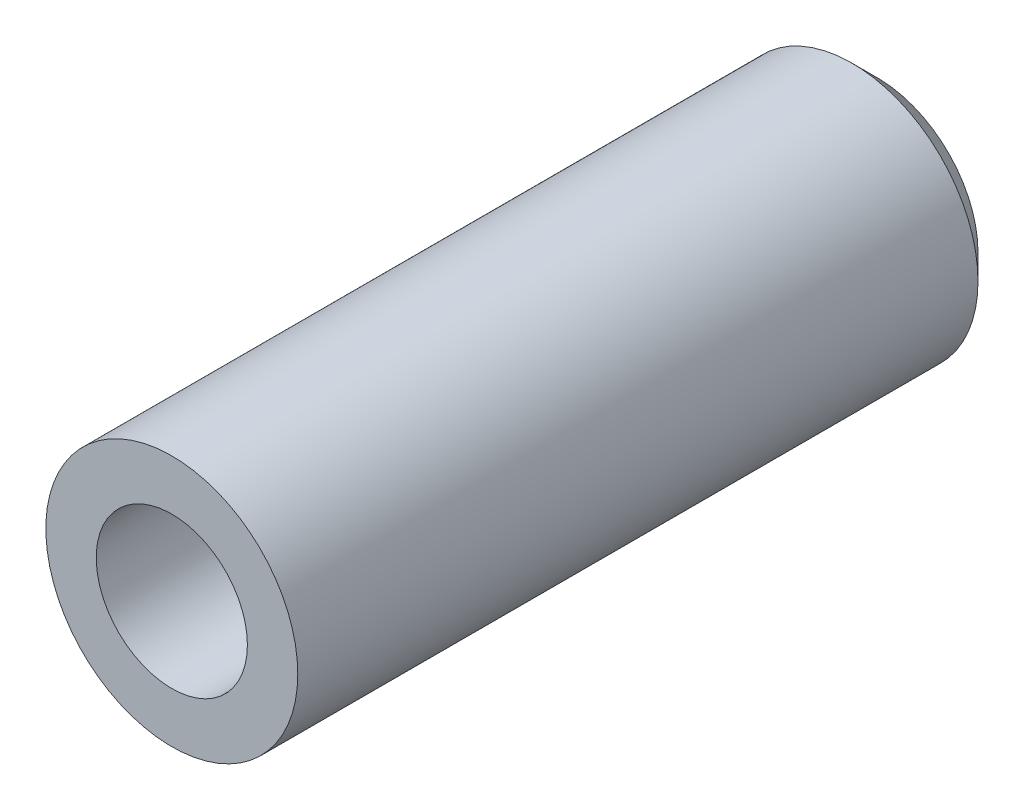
ISO-10303-21;
HEADER;
FILE_DESCRIPTION(('STEP AP214'),'2;1');
FILE_NAME('part.step','',(''),(''),'','','');
FILE_SCHEMA(('AUTOMOTIVE_DESIGN { 1 0 10303 214 1 1 1 1 }'));
ENDSEC;
DATA;
#1=APPLICATION_CONTEXT('core data for automotive mechanical design processes');
#2=APPLICATION_PROTOCOL_DEFINITION('international standard','automotive_design',2000,#1);
#3=PRODUCT_CONTEXT('',#1,'mechanical');
#4=PRODUCT('Part','Part','',(#3));
#5=PRODUCT_RELATED_PRODUCT_CATEGORY('part','',(#4));
#6=PRODUCT_DEFINITION_FORMATION('','',#4);
#7=PRODUCT_DEFINITION_CONTEXT('part definition',#1,'design');
#8=PRODUCT_DEFINITION('design','',#6,#7);
#9=PRODUCT_DEFINITION_SHAPE('','',#8);
#10=(LENGTH_UNIT() NAMED_UNIT(*) SI_UNIT(.MILLI.,.METRE.));
#11=(NAMED_UNIT(*) PLANE_ANGLE_UNIT() SI_UNIT($,.RADIAN.));
#12=(NAMED_UNIT(*) SI_UNIT($,.STERADIAN.) SOLID_ANGLE_UNIT());
#13=UNCERTAINTY_MEASURE_WITH_UNIT(LENGTH_MEASURE(1.E-05),#10,'distance_accuracy_value','');
#14=(GEOMETRIC_REPRESENTATION_CONTEXT(3) GLOBAL_UNCERTAINTY_ASSIGNED_CONTEXT((#13)) GLOBAL_UNIT_ASSIGNED_CONTEXT((#10,
#11,#12)) REPRESENTATION_CONTEXT('',''));
#15=CARTESIAN_POINT('',(0.,0.,0.));
#16=DIRECTION('',(0.,0.,1.));
#17=DIRECTION('',(1.,0.,0.));
#18=AXIS2_PLACEMENT_3D('',#15,#16,#17);
#19=CARTESIAN_POINT('',(38.3796142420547,299.393845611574,28.));
#20=DIRECTION('',(0.,0.,-1.));
#21=DIRECTION('',(-1.,0.,0.));
#22=AXIS2_PLACEMENT_3D('',#19,#20,#21);
#23=CYLINDRICAL_SURFACE('',#22,4.9999999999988);
#24=CARTESIAN_POINT('',(38.3796142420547,299.393845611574,0.999999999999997));
#25=DIRECTION('',(0.,0.,1.));
#26=DIRECTION('',(1.,0.,0.));
#27=AXIS2_PLACEMENT_3D('',#24,#25,#26);
#28=CIRCLE('',#27,4.9999999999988);
#29=CARTESIAN_POINT('',(43.3796142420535,299.393845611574,0.999999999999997));
#30=VERTEX_POINT('',#29);
#31=EDGE_CURVE('E43',#30,#30,#28,.T.);
#32=ORIENTED_EDGE('',*,*,#31,.T.);
#33=EDGE_LOOP('',(#32));
#34=FACE_BOUND('',#33,.T.);
#35=CARTESIAN_POINT('',(38.3796142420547,299.393845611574,28.));
#36=DIRECTION('',(0.,0.,1.));
#37=DIRECTION('',(1.,0.,0.));
#38=AXIS2_PLACEMENT_3D('',#35,#36,#37);
#39=CIRCLE('',#38,4.9999999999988);
#40=CARTESIAN_POINT('',(43.3796142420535,299.393845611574,28.));
#41=VERTEX_POINT('',#40);
#42=EDGE_CURVE('E47',#41,#41,#39,.T.);
#43=ORIENTED_EDGE('',*,*,#42,.F.);
#44=EDGE_LOOP('',(#43));
#45=FACE_BOUND('',#44,.T.);
#46=ADVANCED_FACE('F36',(#34,#45),#23,.T.);
#47=CARTESIAN_POINT('',(38.3796142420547,299.393845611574,28.));
#48=DIRECTION('',(0.,0.,1.));
#49=DIRECTION('',(1.,0.,0.));
#50=AXIS2_PLACEMENT_3D('',#47,#48,#49);
#51=PLANE('',#50);
#52=CARTESIAN_POINT('',(38.3796142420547,299.393845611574,28.));
#53=DIRECTION('',(0.,0.,1.));
#54=DIRECTION('',(1.,0.,0.));
#55=AXIS2_PLACEMENT_3D('',#52,#53,#54);
#56=CIRCLE('',#55,3.);
#57=CARTESIAN_POINT('',(41.3796142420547,299.393845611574,28.));
#58=VERTEX_POINT('',#57);
#59=EDGE_CURVE('E54',#58,#58,#56,.T.);
#60=ORIENTED_EDGE('',*,*,#59,.F.);
#61=EDGE_LOOP('',(#60));
#62=FACE_BOUND('',#61,.T.);
#63=ORIENTED_EDGE('',*,*,#42,.T.);
#64=EDGE_LOOP('',(#63));
#65=FACE_BOUND('',#64,.T.);
#66=ADVANCED_FACE('F86',(#62,#65),#51,.T.);
#67=CARTESIAN_POINT('',(38.3796142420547,299.393845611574,0.));
#68=DIRECTION('',(0.,0.,1.));
#69=DIRECTION('',(1.,0.,0.));
#70=AXIS2_PLACEMENT_3D('',#67,#68,#69);
#71=PLANE('',#70);
#72=CARTESIAN_POINT('',(38.3796142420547,299.393845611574,0.));
#73=DIRECTION('',(0.,0.,1.));
#74=DIRECTION('',(1.,0.,0.));
#75=AXIS2_PLACEMENT_3D('',#72,#73,#74);
#76=CIRCLE('',#75,3.9999999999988);
#77=CARTESIAN_POINT('',(42.3796142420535,299.393845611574,0.));
#78=VERTEX_POINT('',#77);
#79=EDGE_CURVE('E10',#78,#78,#76,.F.);
#80=ORIENTED_EDGE('',*,*,#79,.T.);
#81=EDGE_LOOP('',(#80));
#82=FACE_BOUND('',#81,.T.);
#83=CARTESIAN_POINT('',(38.3796142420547,299.393845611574,0.));
#84=DIRECTION('',(0.,0.,1.));
#85=DIRECTION('',(1.,0.,0.));
#86=AXIS2_PLACEMENT_3D('',#83,#84,#85);
#87=CIRCLE('',#86,0.999999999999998);
#88=CARTESIAN_POINT('',(39.3796142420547,299.393845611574,0.));
#89=VERTEX_POINT('',#88);
#90=EDGE_CURVE('E57',#89,#89,#87,.T.);
#91=ORIENTED_EDGE('',*,*,#90,.T.);
#92=EDGE_LOOP('',(#91));
#93=FACE_BOUND('',#92,.T.);
#94=ADVANCED_FACE('F66',(#82,#93),#71,.F.);
#95=CARTESIAN_POINT('',(38.3796142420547,299.393845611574,15.));
#96=DIRECTION('',(0.,0.,1.));
#97=DIRECTION('',(1.,0.,0.));
#98=AXIS2_PLACEMENT_3D('',#95,#96,#97);
#99=CYLINDRICAL_SURFACE('',#98,3.);
#100=CARTESIAN_POINT('',(38.3796142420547,299.393845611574,15.));
#101=DIRECTION('',(0.,0.,1.));
#102=DIRECTION('',(1.,0.,0.));
#103=AXIS2_PLACEMENT_3D('',#100,#101,#102);
#104=CIRCLE('',#103,3.);
#105=CARTESIAN_POINT('',(41.3796142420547,299.393845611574,15.));
#106=VERTEX_POINT('',#105);
#107=EDGE_CURVE('E51',#106,#106,#104,.T.);
#108=CARTESIAN_POINT('',(41.3796142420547,299.393845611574,15.));
#109=CARTESIAN_POINT('',(41.3796142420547,299.393845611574,15.1354166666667));
#110=CARTESIAN_POINT('',(41.3796142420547,299.393845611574,15.2708333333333));
#111=CARTESIAN_POINT('',(41.3796142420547,299.393845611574,15.5416666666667));
#112=CARTESIAN_POINT('',(41.3796142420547,299.393845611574,15.6770833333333));
#113=CARTESIAN_POINT('',(41.3796142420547,299.393845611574,15.9479166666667));
#114=CARTESIAN_POINT('',(41.3796142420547,299.393845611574,16.0833333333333));
#115=CARTESIAN_POINT('',(41.3796142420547,299.393845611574,16.3541666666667));
#116=CARTESIAN_POINT('',(41.3796142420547,299.393845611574,16.4895833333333));
#117=CARTESIAN_POINT('',(41.3796142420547,299.393845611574,16.7604166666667));
#118=CARTESIAN_POINT('',(41.3796142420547,299.393845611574,16.8958333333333));
#119=CARTESIAN_POINT('',(41.3796142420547,299.393845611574,17.1666666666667));
#120=CARTESIAN_POINT('',(41.3796142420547,299.393845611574,17.3020833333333));
#121=CARTESIAN_POINT('',(41.3796142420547,299.393845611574,17.5729166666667));
#122=CARTESIAN_POINT('',(41.3796142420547,299.393845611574,17.7083333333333));
#123=CARTESIAN_POINT('',(41.3796142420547,299.393845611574,17.9791666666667));
#124=CARTESIAN_POINT('',(41.3796142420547,299.393845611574,18.1145833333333));
#125=CARTESIAN_POINT('',(41.3796142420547,299.393845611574,18.3854166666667));
#126=CARTESIAN_POINT('',(41.3796142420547,299.393845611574,18.5208333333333));
#127=CARTESIAN_POINT('',(41.3796142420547,299.393845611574,18.7916666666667));
#128=CARTESIAN_POINT('',(41.3796142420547,299.393845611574,18.9270833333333));
#129=CARTESIAN_POINT('',(41.3796142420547,299.393845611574,19.1979166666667));
#130=CARTESIAN_POINT('',(41.3796142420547,299.393845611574,19.3333333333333));
#131=CARTESIAN_POINT('',(41.3796142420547,299.393845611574,19.6041666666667));
#132=CARTESIAN_POINT('',(41.3796142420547,299.393845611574,19.7395833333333));
#133=CARTESIAN_POINT('',(41.3796142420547,299.393845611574,20.0104166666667));
#134=CARTESIAN_POINT('',(41.3796142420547,299.393845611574,20.1458333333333));
#135=CARTESIAN_POINT('',(41.3796142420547,299.393845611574,20.4166666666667));
#136=CARTESIAN_POINT('',(41.3796142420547,299.393845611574,20.5520833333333));
#137=CARTESIAN_POINT('',(41.3796142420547,299.393845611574,20.8229166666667));
#138=CARTESIAN_POINT('',(41.3796142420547,299.393845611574,20.9583333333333));
#139=CARTESIAN_POINT('',(41.3796142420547,299.393845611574,21.2291666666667));
#140=CARTESIAN_POINT('',(41.3796142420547,299.393845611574,21.3645833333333));
#141=CARTESIAN_POINT('',(41.3796142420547,299.393845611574,21.6354166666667));
#142=CARTESIAN_POINT('',(41.3796142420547,299.393845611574,21.7708333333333));
#143=CARTESIAN_POINT('',(41.3796142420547,299.393845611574,22.0416666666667));
#144=CARTESIAN_POINT('',(41.3796142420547,299.393845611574,22.1770833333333));
#145=CARTESIAN_POINT('',(41.3796142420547,299.393845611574,22.4479166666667));
#146=CARTESIAN_POINT('',(41.3796142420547,299.393845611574,22.5833333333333));
#147=CARTESIAN_POINT('',(41.3796142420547,299.393845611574,22.8541666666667));
#148=CARTESIAN_POINT('',(41.3796142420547,299.393845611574,22.9895833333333));
#149=CARTESIAN_POINT('',(41.3796142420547,299.393845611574,23.2604166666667));
#150=CARTESIAN_POINT('',(41.3796142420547,299.393845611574,23.3958333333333));
#151=CARTESIAN_POINT('',(41.3796142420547,299.393845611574,23.6666666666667));
#152=CARTESIAN_POINT('',(41.3796142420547,299.393845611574,23.8020833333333));
#153=CARTESIAN_POINT('',(41.3796142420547,299.393845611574,24.0729166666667));
#154=CARTESIAN_POINT('',(41.3796142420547,299.393845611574,24.2083333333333));
#155=CARTESIAN_POINT('',(41.3796142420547,299.393845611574,24.4791666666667));
#156=CARTESIAN_POINT('',(41.3796142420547,299.393845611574,24.6145833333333));
#157=CARTESIAN_POINT('',(41.3796142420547,299.393845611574,24.8854166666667));
#158=CARTESIAN_POINT('',(41.3796142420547,299.393845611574,25.0208333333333));
#159=CARTESIAN_POINT('',(41.3796142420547,299.393845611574,25.2916666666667));
#160=CARTESIAN_POINT('',(41.3796142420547,299.393845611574,25.4270833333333));
#161=CARTESIAN_POINT('',(41.3796142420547,299.393845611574,25.6979166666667));
#162=CARTESIAN_POINT('',(41.3796142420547,299.393845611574,25.8333333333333));
#163=CARTESIAN_POINT('',(41.3796142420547,299.393845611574,26.1041666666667));
#164=CARTESIAN_POINT('',(41.3796142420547,299.393845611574,26.2395833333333));
#165=CARTESIAN_POINT('',(41.3796142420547,299.393845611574,26.5104166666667));
#166=CARTESIAN_POINT('',(41.3796142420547,299.393845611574,26.6458333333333));
#167=CARTESIAN_POINT('',(41.3796142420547,299.393845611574,26.9166666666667));
#168=CARTESIAN_POINT('',(41.3796142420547,299.393845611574,27.0520833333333));
#169=CARTESIAN_POINT('',(41.3796142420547,299.393845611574,27.3229166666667));
#170=CARTESIAN_POINT('',(41.3796142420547,299.393845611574,27.4583333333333));
#171=CARTESIAN_POINT('',(41.3796142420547,299.393845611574,27.7291666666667));
#172=CARTESIAN_POINT('',(41.3796142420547,299.393845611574,27.8645833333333));
#173=CARTESIAN_POINT('',(41.3796142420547,299.393845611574,28.));
#174=B_SPLINE_CURVE_WITH_KNOTS('',3,(#108,#109,#110,#111,#112,#113,#114,#115,#116,#117,#118,
#119,#120,#121,#122,#123,#124,#125,#126,#127,#128,#129,#130,#131,#132,#133,#134,#135,#136,#137,
#138,#139,#140,#141,#142,#143,#144,#145,#146,#147,#148,#149,#150,#151,#152,#153,#154,#155,#156,
#157,#158,#159,#160,#161,#162,#163,#164,#165,#166,#167,#168,#169,#170,#171,#172,#173),
.UNSPECIFIED.,.F.,.F.,(4,2,2,2,2,2,2,2,2,2,2,2,2,2,2,2,2,2,2,2,2,2,2,2,2,2,2,2,2,2,2,2,4),(0.,
0.406249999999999,0.812499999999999,1.21875,1.625,2.03125,2.4375,2.84375,3.25,3.65625,4.0625,
4.46875,4.875,5.28125,5.6875,6.09375,6.5,6.90625,7.3125,7.71875,8.125,8.53125,8.9375,9.34375,
9.75,10.15625,10.5625,10.96875,11.375,11.78125,12.1875,12.59375,13.),.UNSPECIFIED.);
#175=EDGE_CURVE('BSEAM77',#106,#58,#174,.T.);
#176=ORIENTED_EDGE('',*,*,#107,.F.);
#177=ORIENTED_EDGE('',*,*,#59,.T.);
#178=ORIENTED_EDGE('',*,*,#175,.T.);
#179=ORIENTED_EDGE('',*,*,#175,.F.);
#180=EDGE_LOOP('',(#176,#178,#177,#179));
#181=FACE_BOUND('',#180,.T.);
#182=ADVANCED_FACE('F77',(#181),#99,.F.);
#183=CARTESIAN_POINT('',(38.3796142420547,299.393845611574,15.));
#184=DIRECTION('',(0.,0.,1.));
#185=DIRECTION('',(1.,0.,0.));
#186=AXIS2_PLACEMENT_3D('',#183,#184,#185);
#187=PLANE('',#186);
#188=CARTESIAN_POINT('',(38.3796142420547,299.393845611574,15.));
#189=DIRECTION('',(0.,0.,1.));
#190=DIRECTION('',(1.,0.,0.));
#191=AXIS2_PLACEMENT_3D('',#188,#189,#190);
#192=CIRCLE('',#191,0.999999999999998);
#193=CARTESIAN_POINT('',(39.3796142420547,299.393845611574,15.));
#194=VERTEX_POINT('',#193);
#195=EDGE_CURVE('E60',#194,#194,#192,.T.);
#196=ORIENTED_EDGE('',*,*,#195,.F.);
#197=EDGE_LOOP('',(#196));
#198=FACE_BOUND('',#197,.T.);
#199=ORIENTED_EDGE('',*,*,#107,.T.);
#200=EDGE_LOOP('',(#199));
#201=FACE_BOUND('',#200,.T.);
#202=ADVANCED_FACE('F71',(#198,#201),#187,.T.);
#203=CARTESIAN_POINT('',(38.3796142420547,299.393845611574,0.));
#204=DIRECTION('',(0.,0.,1.));
#205=DIRECTION('',(1.,0.,0.));
#206=AXIS2_PLACEMENT_3D('',#203,#204,#205);
#207=CYLINDRICAL_SURFACE('',#206,0.999999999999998);
#208=CARTESIAN_POINT('',(39.3796142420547,299.393845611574,0.));
#209=CARTESIAN_POINT('',(39.3796142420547,299.393845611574,0.15625));
#210=CARTESIAN_POINT('',(39.3796142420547,299.393845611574,0.3125));
#211=CARTESIAN_POINT('',(39.3796142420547,299.393845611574,0.625));
#212=CARTESIAN_POINT('',(39.3796142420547,299.393845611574,0.78125));
#213=CARTESIAN_POINT('',(39.3796142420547,299.393845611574,1.09375));
#214=CARTESIAN_POINT('',(39.3796142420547,299.393845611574,1.25));
#215=CARTESIAN_POINT('',(39.3796142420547,299.393845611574,1.5625));
#216=CARTESIAN_POINT('',(39.3796142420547,299.393845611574,1.71875));
#217=CARTESIAN_POINT('',(39.3796142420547,299.393845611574,2.03125));
#218=CARTESIAN_POINT('',(39.3796142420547,299.393845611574,2.1875));
#219=CARTESIAN_POINT('',(39.3796142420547,299.393845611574,2.5));
#220=CARTESIAN_POINT('',(39.3796142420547,299.393845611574,2.65625));
#221=CARTESIAN_POINT('',(39.3796142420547,299.393845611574,2.96875));
#222=CARTESIAN_POINT('',(39.3796142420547,299.393845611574,3.125));
#223=CARTESIAN_POINT('',(39.3796142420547,299.393845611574,3.4375));
#224=CARTESIAN_POINT('',(39.3796142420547,299.393845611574,3.59375));
#225=CARTESIAN_POINT('',(39.3796142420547,299.393845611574,3.90625));
#226=CARTESIAN_POINT('',(39.3796142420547,299.393845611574,4.0625));
#227=CARTESIAN_POINT('',(39.3796142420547,299.393845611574,4.375));
#228=CARTESIAN_POINT('',(39.3796142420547,299.393845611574,4.53125));
#229=CARTESIAN_POINT('',(39.3796142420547,299.393845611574,4.84375));
#230=CARTESIAN_POINT('',(39.3796142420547,299.393845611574,5.));
#231=CARTESIAN_POINT('',(39.3796142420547,299.393845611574,5.3125));
#232=CARTESIAN_POINT('',(39.3796142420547,299.393845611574,5.46875));
#233=CARTESIAN_POINT('',(39.3796142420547,299.393845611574,5.78125));
#234=CARTESIAN_POINT('',(39.3796142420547,299.393845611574,5.9375));
#235=CARTESIAN_POINT('',(39.3796142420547,299.393845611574,6.25));
#236=CARTESIAN_POINT('',(39.3796142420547,299.393845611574,6.40625));
#237=CARTESIAN_POINT('',(39.3796142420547,299.393845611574,6.71875));
#238=CARTESIAN_POINT('',(39.3796142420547,299.393845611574,6.875));
#239=CARTESIAN_POINT('',(39.3796142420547,299.393845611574,7.1875));
#240=CARTESIAN_POINT('',(39.3796142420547,299.393845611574,7.34375));
#241=CARTESIAN_POINT('',(39.3796142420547,299.393845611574,7.65625));
#242=CARTESIAN_POINT('',(39.3796142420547,299.393845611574,7.8125));
#243=CARTESIAN_POINT('',(39.3796142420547,299.393845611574,8.125));
#244=CARTESIAN_POINT('',(39.3796142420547,299.393845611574,8.28125));
#245=CARTESIAN_POINT('',(39.3796142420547,299.393845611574,8.59375));
#246=CARTESIAN_POINT('',(39.3796142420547,299.393845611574,8.75));
#247=CARTESIAN_POINT('',(39.3796142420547,299.393845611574,9.0625));
#248=CARTESIAN_POINT('',(39.3796142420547,299.393845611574,9.21875));
#249=CARTESIAN_POINT('',(39.3796142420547,299.393845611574,9.53125));
#250=CARTESIAN_POINT('',(39.3796142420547,299.393845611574,9.6875));
#251=CARTESIAN_POINT('',(39.3796142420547,299.393845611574,10.));
#252=CARTESIAN_POINT('',(39.3796142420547,299.393845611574,10.15625));
#253=CARTESIAN_POINT('',(39.3796142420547,299.393845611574,10.46875));
#254=CARTESIAN_POINT('',(39.3796142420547,299.393845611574,10.625));
#255=CARTESIAN_POINT('',(39.3796142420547,299.393845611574,10.9375));
#256=CARTESIAN_POINT('',(39.3796142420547,299.393845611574,11.09375));
#257=CARTESIAN_POINT('',(39.3796142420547,299.393845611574,11.40625));
#258=CARTESIAN_POINT('',(39.3796142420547,299.393845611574,11.5625));
#259=CARTESIAN_POINT('',(39.3796142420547,299.393845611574,11.875));
#260=CARTESIAN_POINT('',(39.3796142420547,299.393845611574,12.03125));
#261=CARTESIAN_POINT('',(39.3796142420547,299.393845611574,12.34375));
#262=CARTESIAN_POINT('',(39.3796142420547,299.393845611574,12.5));
#263=CARTESIAN_POINT('',(39.3796142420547,299.393845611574,12.8125));
#264=CARTESIAN_POINT('',(39.3796142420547,299.393845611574,12.96875));
#265=CARTESIAN_POINT('',(39.3796142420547,299.393845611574,13.28125));
#266=CARTESIAN_POINT('',(39.3796142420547,299.393845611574,13.4375));
#267=CARTESIAN_POINT('',(39.3796142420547,299.393845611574,13.75));
#268=CARTESIAN_POINT('',(39.3796142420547,299.393845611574,13.90625));
#269=CARTESIAN_POINT('',(39.3796142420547,299.393845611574,14.21875));
#270=CARTESIAN_POINT('',(39.3796142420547,299.393845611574,14.375));
#271=CARTESIAN_POINT('',(39.3796142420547,299.393845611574,14.6875));
#272=CARTESIAN_POINT('',(39.3796142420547,299.393845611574,14.84375));
#273=CARTESIAN_POINT('',(39.3796142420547,299.393845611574,15.));
#274=B_SPLINE_CURVE_WITH_KNOTS('',3,(#208,#209,#210,#211,#212,#213,#214,#215,#216,#217,#218,
#219,#220,#221,#222,#223,#224,#225,#226,#227,#228,#229,#230,#231,#232,#233,#234,#235,#236,#237,
#238,#239,#240,#241,#242,#243,#244,#245,#246,#247,#248,#249,#250,#251,#252,#253,#254,#255,#256,
#257,#258,#259,#260,#261,#262,#263,#264,#265,#266,#267,#268,#269,#270,#271,#272,#273),
.UNSPECIFIED.,.F.,.F.,(4,2,2,2,2,2,2,2,2,2,2,2,2,2,2,2,2,2,2,2,2,2,2,2,2,2,2,2,2,2,2,2,4),(0.,
0.46875,0.9375,1.40625,1.875,2.34375,2.8125,3.28125,3.75,4.21875,4.6875,5.15625,5.625,6.09375,
6.5625,7.03125,7.5,7.96875,8.4375,8.90625,9.375,9.84375,10.3125,10.78125,11.25,11.71875,12.1875,
12.65625,13.125,13.59375,14.0625,14.53125,15.),.UNSPECIFIED.);
#275=EDGE_CURVE('BSEAM68',#89,#194,#274,.T.);
#276=ORIENTED_EDGE('',*,*,#90,.F.);
#277=ORIENTED_EDGE('',*,*,#195,.T.);
#278=ORIENTED_EDGE('',*,*,#275,.T.);
#279=ORIENTED_EDGE('',*,*,#275,.F.);
#280=EDGE_LOOP('',(#276,#278,#277,#279));
#281=FACE_BOUND('',#280,.T.);
#282=ADVANCED_FACE('F68',(#281),#207,.F.);
#283=CARTESIAN_POINT('',(38.3796142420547,299.393845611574,0.999999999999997));
#284=DIRECTION('',(0.,0.,1.));
#285=DIRECTION('',(1.,0.,0.));
#286=AXIS2_PLACEMENT_3D('',#283,#284,#285);
#287=CONICAL_SURFACE('',#286,4.9999999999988,0.785398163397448);
#288=ORIENTED_EDGE('',*,*,#79,.F.);
#289=EDGE_LOOP('',(#288));
#290=FACE_BOUND('',#289,.T.);
#291=ORIENTED_EDGE('',*,*,#31,.F.);
#292=EDGE_LOOP('',(#291));
#293=FACE_BOUND('',#292,.T.);
#294=ADVANCED_FACE('F38',(#290,#293),#287,.T.);
#295=CLOSED_SHELL('',(#46,#66,#94,#182,#202,#282,#294));
#296=MANIFOLD_SOLID_BREP('B2',#295);
#297=ADVANCED_BREP_SHAPE_REPRESENTATION('',(#18,#296),#14);
#298=SHAPE_DEFINITION_REPRESENTATION(#9,#297);
ENDSEC;
END-ISO-10303-21;
